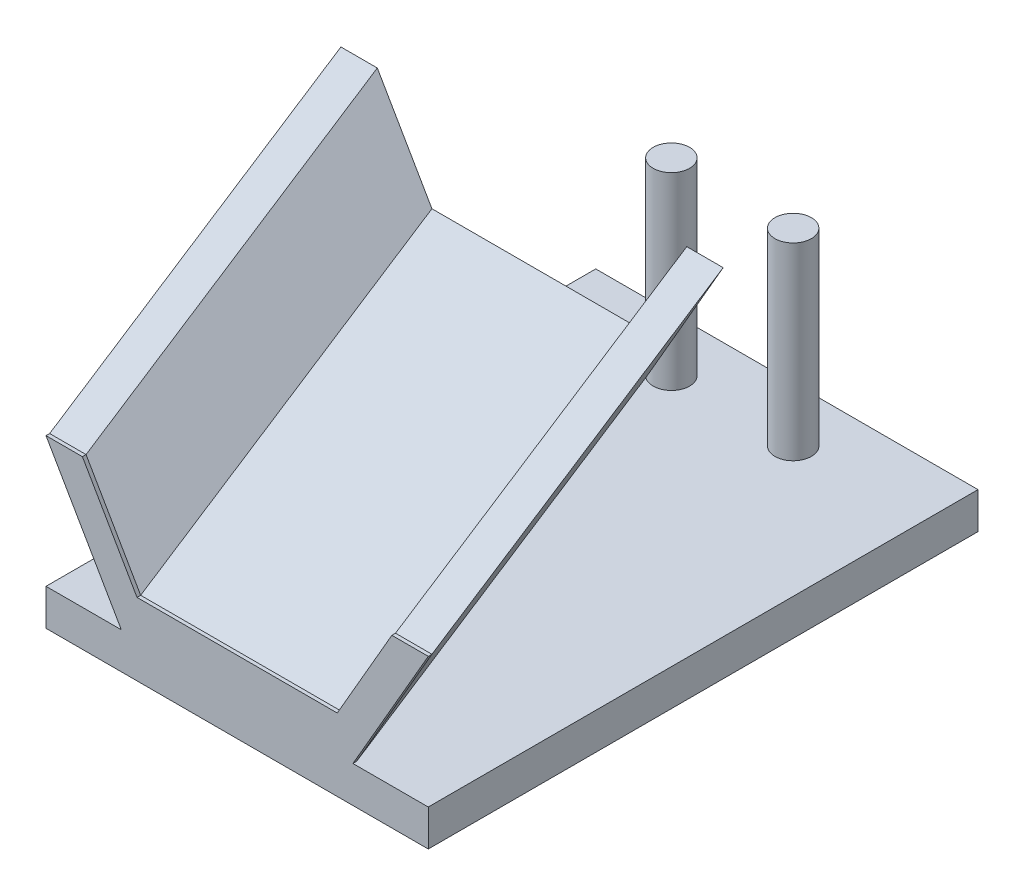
ISO-10303-21;
HEADER;
FILE_DESCRIPTION(('STEP AP214'),'2;1');
FILE_NAME('part.step','',(''),(''),'','','');
FILE_SCHEMA(('AUTOMOTIVE_DESIGN { 1 0 10303 214 1 1 1 1 }'));
ENDSEC;
DATA;
#1=APPLICATION_CONTEXT('core data for automotive mechanical design processes');
#2=APPLICATION_PROTOCOL_DEFINITION('international standard','automotive_design',2000,#1);
#3=PRODUCT_CONTEXT('',#1,'mechanical');
#4=PRODUCT('Part','Part','',(#3));
#5=PRODUCT_RELATED_PRODUCT_CATEGORY('part','',(#4));
#6=PRODUCT_DEFINITION_FORMATION('','',#4);
#7=PRODUCT_DEFINITION_CONTEXT('part definition',#1,'design');
#8=PRODUCT_DEFINITION('design','',#6,#7);
#9=PRODUCT_DEFINITION_SHAPE('','',#8);
#10=(LENGTH_UNIT() NAMED_UNIT(*) SI_UNIT(.MILLI.,.METRE.));
#11=(NAMED_UNIT(*) PLANE_ANGLE_UNIT() SI_UNIT($,.RADIAN.));
#12=(NAMED_UNIT(*) SI_UNIT($,.STERADIAN.) SOLID_ANGLE_UNIT());
#13=UNCERTAINTY_MEASURE_WITH_UNIT(LENGTH_MEASURE(1.E-05),#10,'distance_accuracy_value','');
#14=(GEOMETRIC_REPRESENTATION_CONTEXT(3) GLOBAL_UNCERTAINTY_ASSIGNED_CONTEXT((#13)) GLOBAL_UNIT_ASSIGNED_CONTEXT((#10,
#11,#12)) REPRESENTATION_CONTEXT('',''));
#15=CARTESIAN_POINT('',(0.,0.,0.));
#16=DIRECTION('',(0.,0.,1.));
#17=DIRECTION('',(1.,0.,0.));
#18=AXIS2_PLACEMENT_3D('',#15,#16,#17);
#19=CARTESIAN_POINT('',(-20.5691061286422,31.2155211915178,-80.));
#20=CARTESIAN_POINT('',(-20.6536279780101,-20.6015526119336,0.));
#21=CARTESIAN_POINT('',(42.883888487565,31.2155211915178,-80.));
#22=CARTESIAN_POINT('',(42.8806157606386,-20.742280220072,0.));
#23=B_SPLINE_SURFACE_WITH_KNOTS('',1,1,((#19,#20),(#21,#22)),.UNSPECIFIED.,.F.,.F.,.F.,(2,2),(2,
2),(0.,1.),(0.,1.),.UNSPECIFIED.);
#24=CARTESIAN_POINT('',(-20.6536279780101,-20.6015526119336,0.));
#25=CARTESIAN_POINT('',(-10.0645862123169,-20.6015526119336,-0.0362112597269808));
#26=CARTESIAN_POINT('',(0.524455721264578,-20.6015526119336,-0.072373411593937));
#27=CARTESIAN_POINT('',(16.4080188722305,-20.6015526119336,-0.126543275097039));
#28=CARTESIAN_POINT('',(21.7025399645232,-20.6015526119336,-0.144587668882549));
#29=CARTESIAN_POINT('',(32.2915822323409,-20.6015526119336,-0.180652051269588));
#30=CARTESIAN_POINT('',(37.5861034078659,-20.6015526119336,-0.198672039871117));
#31=CARTESIAN_POINT('',(42.8806246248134,-20.6015526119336,-0.216679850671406));
#32=B_SPLINE_CURVE_WITH_KNOTS('',3,(#24,#25,#26,#27,#28,#29,#30,#31),.UNSPECIFIED.,.F.,.F.,(4,2,
2,4),(0.,31.7673110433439,47.6509665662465,63.5346220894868),.UNSPECIFIED.);
#33=CARTESIAN_POINT('',(-20.6536279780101,-20.6015526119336,0.));
#34=VERTEX_POINT('',#33);
#35=CARTESIAN_POINT('',(42.8806246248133,-20.6015526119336,-0.216679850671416));
#36=VERTEX_POINT('',#35);
#37=EDGE_CURVE('E325',#34,#36,#32,.T.);
#38=DIRECTION('',(-0.000886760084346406,-0.543638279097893,0.839319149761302));
#39=VECTOR('',#38,1.);
#40=CARTESIAN_POINT('',(-20.6113670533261,5.3069842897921,-40.));
#41=LINE('',#40,#39);
#42=CARTESIAN_POINT('',(-20.5691061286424,31.215521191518,-79.9999999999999));
#43=VERTEX_POINT('',#42);
#44=EDGE_CURVE('E268',#43,#34,#41,.T.);
#45=DIRECTION('',(-1.,0.,0.));
#46=VECTOR('',#45,1.);
#47=CARTESIAN_POINT('',(42.883888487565,31.2155211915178,-80.0000000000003));
#48=LINE('',#47,#46);
#49=CARTESIAN_POINT('',(42.883888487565,31.215521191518,-80.0000000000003));
#50=VERTEX_POINT('',#49);
#51=EDGE_CURVE('E255',#50,#43,#48,.T.);
#52=DIRECTION('',(-3.43082293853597E-05,-0.544677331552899,0.838645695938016));
#53=VECTOR('',#52,1.);
#54=CARTESIAN_POINT('',(42.8822521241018,5.23662048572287,-40.));
#55=LINE('',#54,#53);
#56=EDGE_CURVE('E265',#50,#36,#55,.T.);
#57=CARTESIAN_POINT('',(-0.637780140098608,-10.9218588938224,-14.9999916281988));
#58=CARTESIAN_POINT('',(-0.637779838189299,-11.0377173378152,-14.8212718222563));
#59=CARTESIAN_POINT('',(-0.647357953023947,-11.1535371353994,-14.6425850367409));
#60=CARTESIAN_POINT('',(-0.685691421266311,-11.3842012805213,-14.2866616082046));
#61=CARTESIAN_POINT('',(-0.714442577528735,-11.4990458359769,-14.1094246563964));
#62=CARTESIAN_POINT('',(-0.791226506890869,-11.7269376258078,-13.7576671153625));
#63=CARTESIAN_POINT('',(-0.839283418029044,-11.8399824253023,-13.5831502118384));
#64=CARTESIAN_POINT('',(-0.954760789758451,-12.0630962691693,-13.2386491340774));
#65=CARTESIAN_POINT('',(-1.02218095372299,-12.1731653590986,-13.0686648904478));
#66=CARTESIAN_POINT('',(-1.17007832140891,-12.3802767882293,-12.7487507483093));
#67=CARTESIAN_POINT('',(-1.24902150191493,-12.4776451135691,-12.5983226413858));
#68=CARTESIAN_POINT('',(-1.42320889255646,-12.6678957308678,-12.3043363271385));
#69=CARTESIAN_POINT('',(-1.518443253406,-12.7607806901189,-12.160774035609));
#70=CARTESIAN_POINT('',(-1.72495137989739,-12.9408857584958,-11.8823379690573));
#71=CARTESIAN_POINT('',(-1.83619636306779,-13.0281156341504,-11.7474492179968));
#72=CARTESIAN_POINT('',(-2.07455690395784,-13.1958810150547,-11.4879484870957));
#73=CARTESIAN_POINT('',(-2.20166559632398,-13.2764193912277,-11.3633321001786));
#74=CARTESIAN_POINT('',(-2.43134522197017,-13.406877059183,-11.1614027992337));
#75=CARTESIAN_POINT('',(-2.53007056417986,-13.458812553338,-11.080991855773));
#76=CARTESIAN_POINT('',(-2.73481303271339,-13.5582344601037,-10.9270100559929));
#77=CARTESIAN_POINT('',(-2.84082842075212,-13.6057219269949,-10.8534375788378));
#78=CARTESIAN_POINT('',(-3.05974098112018,-13.6957497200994,-10.7139023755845));
#79=CARTESIAN_POINT('',(-3.17263754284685,-13.7382904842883,-10.6479389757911));
#80=CARTESIAN_POINT('',(-3.40471934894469,-13.8179064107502,-10.5244237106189));
#81=CARTESIAN_POINT('',(-3.52390152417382,-13.8549842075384,-10.4668677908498));
#82=CARTESIAN_POINT('',(-3.76873788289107,-13.9234396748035,-10.3605290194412));
#83=CARTESIAN_POINT('',(-3.89443061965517,-13.9547768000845,-10.3118085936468));
#84=CARTESIAN_POINT('',(-4.15059709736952,-14.010959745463,-10.22436679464));
#85=CARTESIAN_POINT('',(-4.28106860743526,-14.0358085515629,-10.1856408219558));
#86=CARTESIAN_POINT('',(-4.5457779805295,-14.0786290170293,-10.1187866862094));
#87=CARTESIAN_POINT('',(-4.68001501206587,-14.0966021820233,-10.0906562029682));
#88=CARTESIAN_POINT('',(-4.95109320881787,-14.125368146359,-10.0454648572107));
#89=CARTESIAN_POINT('',(-5.08793407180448,-14.1361617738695,-10.0284027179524));
#90=CARTESIAN_POINT('',(-5.3479624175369,-14.1496054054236,-10.0068834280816));
#91=CARTESIAN_POINT('',(-5.47101574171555,-14.1530135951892,-10.0012569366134));
#92=CARTESIAN_POINT('',(-5.71722157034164,-14.1539294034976,-9.99910759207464));
#93=CARTESIAN_POINT('',(-5.84037406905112,-14.1514373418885,-10.0025842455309));
#94=CARTESIAN_POINT('',(-6.08579750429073,-14.140590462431,-10.0185862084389));
#95=CARTESIAN_POINT('',(-6.20806864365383,-14.1322370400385,-10.0311093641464));
#96=CARTESIAN_POINT('',(-6.4508385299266,-14.1097898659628,-10.065018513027));
#97=CARTESIAN_POINT('',(-6.57133726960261,-14.0956960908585,-10.0864045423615));
#98=CARTESIAN_POINT('',(-6.80531585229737,-14.0625828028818,-10.1367986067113));
#99=CARTESIAN_POINT('',(-6.91889082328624,-14.04376358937,-10.1654972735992));
#100=CARTESIAN_POINT('',(-7.14291679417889,-14.0012122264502,-10.2304854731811));
#101=CARTESIAN_POINT('',(-7.25336677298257,-13.9774784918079,-10.2667774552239));
#102=CARTESIAN_POINT('',(-7.57901238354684,-13.8993076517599,-10.3864263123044));
#103=CARTESIAN_POINT('',(-7.78868734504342,-13.8378744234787,-10.4805964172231));
#104=CARTESIAN_POINT('',(-8.20273716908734,-13.6941299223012,-10.7011738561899));
#105=CARTESIAN_POINT('',(-8.40575522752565,-13.6106731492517,-10.8293531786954));
#106=CARTESIAN_POINT('',(-8.78715599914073,-13.4285214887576,-11.1093052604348));
#107=CARTESIAN_POINT('',(-8.96552753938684,-13.3298197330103,-11.261088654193));
#108=CARTESIAN_POINT('',(-9.31854927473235,-13.1057946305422,-11.6057538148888));
#109=CARTESIAN_POINT('',(-9.48933658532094,-12.9786767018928,-11.8014171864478));
#110=CARTESIAN_POINT('',(-9.79596024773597,-12.71231220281,-12.2115700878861));
#111=CARTESIAN_POINT('',(-9.9317216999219,-12.5730404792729,-12.4260986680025));
#112=CARTESIAN_POINT('',(-10.1867135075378,-12.2626990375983,-12.9042805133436));
#113=CARTESIAN_POINT('',(-10.2997292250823,-12.0901273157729,-13.1702707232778));
#114=CARTESIAN_POINT('',(-10.4777543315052,-11.7380651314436,-13.713071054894));
#115=CARTESIAN_POINT('',(-10.5428048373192,-11.5585807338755,-13.989871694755));
#116=CARTESIAN_POINT('',(-10.6074434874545,-11.2750474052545,-14.4272459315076));
#117=CARTESIAN_POINT('',(-10.6231809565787,-11.1719895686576,-14.586243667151));
#118=CARTESIAN_POINT('',(-10.6394133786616,-10.9656217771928,-14.9046710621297));
#119=CARTESIAN_POINT('',(-10.6399180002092,-10.8623120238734,-15.0641003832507));
#120=CARTESIAN_POINT('',(-10.6185196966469,-10.5526199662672,-15.5420852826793));
#121=CARTESIAN_POINT('',(-10.5736921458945,-10.3465299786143,-15.8602527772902));
#122=CARTESIAN_POINT('',(-10.4587617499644,-10.0380464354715,-16.3366242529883));
#123=CARTESIAN_POINT('',(-10.4108578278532,-9.93300345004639,-16.4988585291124));
#124=CARTESIAN_POINT('',(-10.2981617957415,-9.72559834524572,-16.8192333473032));
#125=CARTESIAN_POINT('',(-10.2333691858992,-9.62323630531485,-16.9773737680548));
#126=CARTESIAN_POINT('',(-10.0869357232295,-9.42227692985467,-17.2878872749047));
#127=CARTESIAN_POINT('',(-10.0053118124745,-9.32367592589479,-17.4402659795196));
#128=CARTESIAN_POINT('',(-9.82519697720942,-9.13116195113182,-17.7378304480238));
#129=CARTESIAN_POINT('',(-9.72671146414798,-9.03724748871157,-17.8830185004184));
#130=CARTESIAN_POINT('',(-9.53854836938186,-8.87698894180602,-18.1308218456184));
#131=CARTESIAN_POINT('',(-9.45238436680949,-8.80941689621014,-18.2353235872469));
#132=CARTESIAN_POINT('',(-9.27050135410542,-8.67819967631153,-18.4382901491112));
#133=CARTESIAN_POINT('',(-9.17478433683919,-8.61455368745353,-18.5367562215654));
#134=CARTESIAN_POINT('',(-8.97400025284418,-8.49177134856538,-18.726751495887));
#135=CARTESIAN_POINT('',(-8.86893280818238,-8.43263518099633,-18.8182804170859));
#136=CARTESIAN_POINT('',(-8.64983776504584,-8.31953266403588,-18.9933816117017));
#137=CARTESIAN_POINT('',(-8.53581408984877,-8.26556407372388,-19.0769573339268));
#138=CARTESIAN_POINT('',(-8.29825108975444,-8.16299425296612,-19.2358488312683));
#139=CARTESIAN_POINT('',(-8.17463887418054,-8.11444274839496,-19.3110880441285));
#140=CARTESIAN_POINT('',(-7.91953385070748,-8.02395907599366,-19.4513705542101));
#141=CARTESIAN_POINT('',(-7.78804529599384,-7.98202337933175,-19.5164192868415));
#142=CARTESIAN_POINT('',(-7.51812616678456,-7.9054350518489,-19.6352945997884));
#143=CARTESIAN_POINT('',(-7.37969908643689,-7.87077879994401,-19.6891267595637));
#144=CARTESIAN_POINT('',(-7.09702739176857,-7.80935114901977,-19.7846379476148));
#145=CARTESIAN_POINT('',(-6.95278389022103,-7.78257824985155,-19.8263192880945));
#146=CARTESIAN_POINT('',(-6.68029604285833,-7.7405818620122,-19.8918190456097));
#147=CARTESIAN_POINT('',(-6.55262027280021,-7.72426934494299,-19.9173165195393));
#148=CARTESIAN_POINT('',(-6.29502546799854,-7.6981225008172,-19.9583210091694));
#149=CARTESIAN_POINT('',(-6.16510671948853,-7.68828735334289,-19.9738292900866));
#150=CARTESIAN_POINT('',(-5.90418933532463,-7.67525697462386,-19.9946033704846));
#151=CARTESIAN_POINT('',(-5.77319128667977,-7.67205834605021,-19.9998744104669));
#152=CARTESIAN_POINT('',(-5.51119527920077,-7.67234430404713,-20.0001049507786));
#153=CARTESIAN_POINT('',(-5.38019732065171,-7.67582857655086,-19.9950649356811));
#154=CARTESIAN_POINT('',(-5.13137122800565,-7.68879424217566,-19.9756986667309));
#155=CARTESIAN_POINT('',(-5.01344129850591,-7.69769376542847,-19.9622703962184));
#156=CARTESIAN_POINT('',(-4.77930087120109,-7.72083722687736,-19.9271643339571));
#157=CARTESIAN_POINT('',(-4.66309104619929,-7.73508320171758,-19.9054833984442));
#158=CARTESIAN_POINT('',(-4.43324432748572,-7.76873128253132,-19.8541606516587));
#159=CARTESIAN_POINT('',(-4.31960672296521,-7.78813194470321,-19.8245210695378));
#160=CARTESIAN_POINT('',(-4.09555916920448,-7.83185541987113,-19.7576406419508));
#161=CARTESIAN_POINT('',(-3.98514944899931,-7.85617858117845,-19.720399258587));
#162=CARTESIAN_POINT('',(-3.76580680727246,-7.91005065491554,-19.6378516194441));
#163=CARTESIAN_POINT('',(-3.65695874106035,-7.93970205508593,-19.5923870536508));
#164=CARTESIAN_POINT('',(-3.44384869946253,-8.00352170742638,-19.4944789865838));
#165=CARTESIAN_POINT('',(-3.33958620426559,-8.03768944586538,-19.4420362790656));
#166=CARTESIAN_POINT('',(-3.13608293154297,-8.11020442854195,-19.3306914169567));
#167=CARTESIAN_POINT('',(-3.03684229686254,-8.1485517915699,-19.2717890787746));
#168=CARTESIAN_POINT('',(-2.84371955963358,-8.22908442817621,-19.1480511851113));
#169=CARTESIAN_POINT('',(-2.74984030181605,-8.27127170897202,-19.0832125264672));
#170=CARTESIAN_POINT('',(-2.45670578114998,-8.41273606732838,-18.8657387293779));
#171=CARTESIAN_POINT('',(-2.2685030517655,-8.51891511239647,-18.702430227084));
#172=CARTESIAN_POINT('',(-1.92211191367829,-8.74490294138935,-18.3547160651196));
#173=CARTESIAN_POINT('',(-1.76395253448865,-8.8647247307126,-18.1702902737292));
#174=CARTESIAN_POINT('',(-1.53873078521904,-9.06202258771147,-17.8665283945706));
#175=CARTESIAN_POINT('',(-1.46134744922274,-9.13609089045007,-17.752474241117));
#176=CARTESIAN_POINT('',(-1.31705042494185,-9.28709819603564,-17.5199117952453));
#177=CARTESIAN_POINT('',(-1.25012695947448,-9.36403443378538,-17.4014077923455));
#178=CARTESIAN_POINT('',(-1.12666782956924,-9.52036008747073,-17.1605895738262));
#179=CARTESIAN_POINT('',(-1.07013674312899,-9.59975056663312,-17.0382737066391));
#180=CARTESIAN_POINT('',(-0.967476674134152,-9.76049183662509,-16.7905916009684));
#181=CARTESIAN_POINT('',(-0.921350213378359,-9.84184309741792,-16.6652246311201));
#182=CARTESIAN_POINT('',(-0.799498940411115,-10.0863001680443,-16.2884588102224));
#183=CARTESIAN_POINT('',(-0.738843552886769,-10.2516816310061,-16.0335106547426));
#184=CARTESIAN_POINT('',(-0.657971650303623,-10.5853543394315,-15.5190175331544));
#185=CARTESIAN_POINT('',(-0.637780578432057,-10.7536473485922,-15.2594697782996));
#186=CARTESIAN_POINT('',(-0.637780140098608,-10.9218588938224,-14.9999916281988));
#187=B_SPLINE_CURVE_WITH_KNOTS('',3,(#57,#58,#59,#60,#61,#62,#63,#64,#65,#66,#67,#68,#69,#70,
#71,#72,#73,#74,#75,#76,#77,#78,#79,#80,#81,#82,#83,#84,#85,#86,#87,#88,#89,#90,#91,#92,#93,#94,
#95,#96,#97,#98,#99,#100,#101,#102,#103,#104,#105,#106,#107,#108,#109,#110,#111,#112,#113,#114,
#115,#116,#117,#118,#119,#120,#121,#122,#123,#124,#125,#126,#127,#128,#129,#130,#131,#132,#133,
#134,#135,#136,#137,#138,#139,#140,#141,#142,#143,#144,#145,#146,#147,#148,#149,#150,#151,#152,
#153,#154,#155,#156,#157,#158,#159,#160,#161,#162,#163,#164,#165,#166,#167,#168,#169,#170,#171,
#172,#173,#174,#175,#176,#177,#178,#179,#180,#181,#182,#183,#184,#185,#186),.UNSPECIFIED.,.T.,
.F.,(4,2,2,2,2,2,2,2,2,2,2,2,2,2,2,2,2,2,2,2,2,2,2,2,2,2,2,2,2,2,2,2,2,2,2,2,2,2,2,2,2,2,2,2,2,
2,2,2,2,2,2,2,2,2,2,2,2,2,2,2,2,2,2,2,4),(0.,0.638663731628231,1.27718770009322,
1.91651251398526,2.55582753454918,3.1424535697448,3.72872618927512,4.31395772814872,
4.89893686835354,5.31108548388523,5.72313616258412,6.13515033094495,6.54696515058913,
6.96158494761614,7.37601359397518,7.79035143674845,8.2046414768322,8.5738618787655,
8.9430622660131,9.31217478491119,9.68128880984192,10.0368227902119,10.3924716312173,
11.1032061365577,11.8628323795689,12.6228018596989,13.4869623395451,14.3529557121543,
15.3588629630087,16.3639069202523,16.9337253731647,17.5031821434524,18.642398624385,
19.2391630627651,19.8359451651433,20.4321294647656,21.0281227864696,21.4817814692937,
21.9353457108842,22.3889282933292,22.8423132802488,23.2995667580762,23.7565755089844,
24.2133563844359,24.6700502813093,25.0631590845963,25.4562180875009,25.849075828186,
26.2419151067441,26.5985750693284,26.9553710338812,27.3120671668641,27.6687885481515,
28.0332972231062,28.3977644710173,28.7622420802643,29.1269113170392,29.9361270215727,
30.7461207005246,31.2151349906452,31.6837082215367,32.1524873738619,32.621380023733,
33.5480550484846,34.4753125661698),.UNSPECIFIED.);
#188=CARTESIAN_POINT('',(-0.637780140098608,-10.9218588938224,-14.9999916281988));
#189=VERTEX_POINT('',#188);
#190=EDGE_CURVE('E12',#189,#189,#187,.T.);
#191=CARTESIAN_POINT('',(32.8647679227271,-10.9821671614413,-14.9999916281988));
#192=CARTESIAN_POINT('',(32.8647682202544,-11.0981379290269,-14.8213539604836));
#193=CARTESIAN_POINT('',(32.85519894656,-11.2140698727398,-14.6427495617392));
#194=CARTESIAN_POINT('',(32.816900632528,-11.444959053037,-14.2869877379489));
#195=CARTESIAN_POINT('',(32.7881758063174,-11.5599164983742,-14.1098300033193));
#196=CARTESIAN_POINT('',(32.7114614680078,-11.7880354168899,-13.758224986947));
#197=CARTESIAN_POINT('',(32.6634478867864,-11.9011944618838,-13.583781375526));
#198=CARTESIAN_POINT('',(32.5480728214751,-12.124539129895,-13.239416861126));
#199=CARTESIAN_POINT('',(32.480711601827,-12.2347247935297,-13.0694958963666));
#200=CARTESIAN_POINT('',(32.3328790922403,-12.4421483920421,-12.7495578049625));
#201=CARTESIAN_POINT('',(32.2539265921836,-12.5397090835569,-12.5990481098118));
#202=CARTESIAN_POINT('',(32.079701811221,-12.7303382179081,-12.3048983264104));
#203=CARTESIAN_POINT('',(31.9844393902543,-12.823409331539,-12.1612541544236));
#204=CARTESIAN_POINT('',(31.777854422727,-13.0038771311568,-11.8826566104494));
#205=CARTESIAN_POINT('',(31.6665607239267,-13.0912836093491,-11.7476882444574));
#206=CARTESIAN_POINT('',(31.428079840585,-13.2593891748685,-11.4880335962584));
#207=CARTESIAN_POINT('',(31.3008995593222,-13.3400911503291,-11.3633428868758));
#208=CARTESIAN_POINT('',(31.0711605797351,-13.4707650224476,-11.1613686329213));
#209=CARTESIAN_POINT('',(30.9724602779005,-13.5227611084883,-11.0809792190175));
#210=CARTESIAN_POINT('',(30.7677680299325,-13.622301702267,-10.9270345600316));
#211=CARTESIAN_POINT('',(30.6617778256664,-13.6698472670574,-10.8534776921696));
#212=CARTESIAN_POINT('',(30.442914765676,-13.7599879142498,-10.7139679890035));
#213=CARTESIAN_POINT('',(30.3300425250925,-13.8025834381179,-10.6480144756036));
#214=CARTESIAN_POINT('',(30.0980074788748,-13.8823045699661,-10.5245136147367));
#215=CARTESIAN_POINT('',(29.9788477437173,-13.9194328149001,-10.4669622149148));
#216=CARTESIAN_POINT('',(29.7340516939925,-13.9879846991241,-10.3606268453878));
#217=CARTESIAN_POINT('',(29.6083767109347,-14.0193676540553,-10.3119054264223));
#218=CARTESIAN_POINT('',(29.3522425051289,-14.0756353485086,-10.224458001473));
#219=CARTESIAN_POINT('',(29.2217855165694,-14.1005230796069,-10.1857273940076));
#220=CARTESIAN_POINT('',(28.9571021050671,-14.1434133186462,-10.1188612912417));
#221=CARTESIAN_POINT('',(28.8228765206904,-14.1614173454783,-10.090723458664));
#222=CARTESIAN_POINT('',(28.551818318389,-14.1902360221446,-10.0455154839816));
#223=CARTESIAN_POINT('',(28.4149860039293,-14.2010515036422,-10.0284440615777));
#224=CARTESIAN_POINT('',(28.1550014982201,-14.2145257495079,-10.0069084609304));
#225=CARTESIAN_POINT('',(28.031983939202,-14.2179451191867,-10.0012728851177));
#226=CARTESIAN_POINT('',(27.7858483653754,-14.218878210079,-9.99910019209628));
#227=CARTESIAN_POINT('',(27.6627303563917,-14.2163922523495,-10.0025625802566));
#228=CARTESIAN_POINT('',(27.4173746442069,-14.2055524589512,-10.0185309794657));
#229=CARTESIAN_POINT('',(27.2951367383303,-14.1972000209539,-10.0310348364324));
#230=CARTESIAN_POINT('',(27.0524320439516,-14.1747498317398,-10.064900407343));
#231=CARTESIAN_POINT('',(26.9319652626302,-14.1606520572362,-10.0862621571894));
#232=CARTESIAN_POINT('',(26.6980634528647,-14.1275284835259,-10.1366003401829));
#233=CARTESIAN_POINT('',(26.5845330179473,-14.1087038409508,-10.1652665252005));
#234=CARTESIAN_POINT('',(26.3605937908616,-14.0661389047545,-10.230183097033));
#235=CARTESIAN_POINT('',(26.2501860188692,-14.0423970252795,-10.2664359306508));
#236=CARTESIAN_POINT('',(25.9246627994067,-13.9641981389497,-10.385957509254));
#237=CARTESIAN_POINT('',(25.7150639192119,-13.9027413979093,-10.4800295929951));
#238=CARTESIAN_POINT('',(25.3011318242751,-13.7589327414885,-10.7003912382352));
#239=CARTESIAN_POINT('',(25.0981566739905,-13.6754328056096,-10.8284541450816));
#240=CARTESIAN_POINT('',(24.7168236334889,-13.493186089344,-11.1081530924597));
#241=CARTESIAN_POINT('',(24.538476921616,-13.3944324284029,-11.2597997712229));
#242=CARTESIAN_POINT('',(24.1854377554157,-13.1702605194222,-11.604198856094));
#243=CARTESIAN_POINT('',(24.0146130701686,-13.0430428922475,-11.7997363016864));
#244=CARTESIAN_POINT('',(23.7078951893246,-12.7764672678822,-12.2096284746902));
#245=CARTESIAN_POINT('',(23.5720768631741,-12.6370840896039,-12.4240222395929));
#246=CARTESIAN_POINT('',(23.3168910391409,-12.3264379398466,-12.9019901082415));
#247=CARTESIAN_POINT('',(23.2037492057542,-12.1536675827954,-13.1679061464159));
#248=CARTESIAN_POINT('',(23.0254620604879,-11.8011931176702,-13.7105657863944));
#249=CARTESIAN_POINT('',(22.9602757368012,-11.6214950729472,-13.9872999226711));
#250=CARTESIAN_POINT('',(22.8954052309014,-11.3375819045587,-14.4246341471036));
#251=CARTESIAN_POINT('',(22.8795817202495,-11.2343618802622,-14.5836544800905));
#252=CARTESIAN_POINT('',(22.8631827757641,-11.0276659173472,-14.9021323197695));
#253=CARTESIAN_POINT('',(22.8625976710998,-10.9241901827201,-15.0615894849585));
#254=CARTESIAN_POINT('',(22.88376219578,-10.6139944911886,-15.5396671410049));
#255=CARTESIAN_POINT('',(22.9284443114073,-10.4075618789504,-15.8579077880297));
#256=CARTESIAN_POINT('',(23.0431821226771,-10.0985244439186,-16.3344518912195));
#257=CARTESIAN_POINT('',(23.0910340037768,-9.9932731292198,-16.4967753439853));
#258=CARTESIAN_POINT('',(23.2036425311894,-9.78545181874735,-16.8173337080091));
#259=CARTESIAN_POINT('',(23.2683996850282,-9.68288190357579,-16.9755684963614));
#260=CARTESIAN_POINT('',(23.4147804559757,-9.48150971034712,-17.2862745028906));
#261=CARTESIAN_POINT('',(23.4963870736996,-9.38270375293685,-17.4387513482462));
#262=CARTESIAN_POINT('',(23.6764877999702,-9.18978481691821,-17.736514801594));
#263=CARTESIAN_POINT('',(23.7749764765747,-9.09567034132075,-17.8818037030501));
#264=CARTESIAN_POINT('',(23.9631216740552,-8.93510397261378,-18.1297274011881));
#265=CARTESIAN_POINT('',(24.0492545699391,-8.86742059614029,-18.2342513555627));
#266=CARTESIAN_POINT('',(24.231079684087,-8.73598256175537,-18.4372681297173));
#267=CARTESIAN_POINT('',(24.3267699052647,-8.67222708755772,-18.5357622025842));
#268=CARTESIAN_POINT('',(24.5275063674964,-8.54922858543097,-18.7258190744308));
#269=CARTESIAN_POINT('',(24.6325529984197,-8.48998574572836,-18.8173815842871));
#270=CARTESIAN_POINT('',(24.851613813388,-8.3766742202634,-18.9925546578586));
#271=CARTESIAN_POINT('',(24.9656240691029,-8.32260329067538,-19.0761686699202));
#272=CARTESIAN_POINT('',(25.2031717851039,-8.21983271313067,-19.2351425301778));
#273=CARTESIAN_POINT('',(25.3267824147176,-8.17118298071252,-19.3104256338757));
#274=CARTESIAN_POINT('',(25.581894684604,-8.08051141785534,-19.4507973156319));
#275=CARTESIAN_POINT('',(25.7133920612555,-8.03848605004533,-19.5158913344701));
#276=CARTESIAN_POINT('',(25.9833393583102,-7.96172940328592,-19.634856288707));
#277=CARTESIAN_POINT('',(26.1217857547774,-7.92699447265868,-19.6887328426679));
#278=CARTESIAN_POINT('',(26.4045067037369,-7.86542274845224,-19.7843297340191));
#279=CARTESIAN_POINT('',(26.5487801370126,-7.83858444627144,-19.8260523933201));
#280=CARTESIAN_POINT('',(26.8212869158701,-7.79648787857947,-19.8916130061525));
#281=CARTESIAN_POINT('',(26.9489493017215,-7.78013631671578,-19.9171341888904));
#282=CARTESIAN_POINT('',(27.2065216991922,-7.75391938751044,-19.9581880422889));
#283=CARTESIAN_POINT('',(27.3364314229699,-7.74405319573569,-19.9737219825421));
#284=CARTESIAN_POINT('',(27.5973344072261,-7.73096950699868,-19.9945484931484));
#285=CARTESIAN_POINT('',(27.7283270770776,-7.72774859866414,-19.9998463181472));
#286=CARTESIAN_POINT('',(27.9903153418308,-7.72799918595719,-20.0001310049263));
#287=CARTESIAN_POINT('',(28.1213109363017,-7.73147036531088,-19.9951183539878));
#288=CARTESIAN_POINT('',(28.3700933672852,-7.74441777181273,-19.9758077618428));
#289=CARTESIAN_POINT('',(28.4879821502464,-7.7533094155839,-19.9624107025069));
#290=CARTESIAN_POINT('',(28.7220428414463,-7.77644094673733,-19.927372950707));
#291=CARTESIAN_POINT('',(28.8382140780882,-7.79068287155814,-19.9057291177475));
#292=CARTESIAN_POINT('',(29.0679863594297,-7.82432653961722,-19.8544862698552));
#293=CARTESIAN_POINT('',(29.1815881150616,-7.84372683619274,-19.824889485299));
#294=CARTESIAN_POINT('',(29.4055669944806,-7.88745303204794,-19.7581001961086));
#295=CARTESIAN_POINT('',(29.5159438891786,-7.91177928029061,-19.7209071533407));
#296=CARTESIAN_POINT('',(29.7352203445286,-7.96566000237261,-19.6384638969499));
#297=CARTESIAN_POINT('',(29.8440352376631,-7.99531689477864,-19.5930557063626));
#298=CARTESIAN_POINT('',(30.0570830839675,-8.05915022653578,-19.49526621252));
#299=CARTESIAN_POINT('',(30.1613165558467,-8.09332615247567,-19.4428857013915));
#300=CARTESIAN_POINT('',(30.3647664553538,-8.16585990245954,-19.331670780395));
#301=CARTESIAN_POINT('',(30.4639827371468,-8.20421784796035,-19.272836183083));
#302=CARTESIAN_POINT('',(30.6570618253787,-8.2847737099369,-19.1492390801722));
#303=CARTESIAN_POINT('',(30.7509217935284,-8.32697363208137,-19.0844734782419));
#304=CARTESIAN_POINT('',(31.0440376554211,-8.46849818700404,-18.8672174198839));
#305=CARTESIAN_POINT('',(31.2322473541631,-8.57473128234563,-18.7040588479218));
#306=CARTESIAN_POINT('',(31.578675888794,-8.80083834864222,-18.3566575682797));
#307=CARTESIAN_POINT('',(31.7368656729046,-8.9207253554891,-18.1723947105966));
#308=CARTESIAN_POINT('',(31.9621807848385,-9.11815358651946,-17.8688659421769));
#309=CARTESIAN_POINT('',(32.0396148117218,-9.19228501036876,-17.7548775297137));
#310=CARTESIAN_POINT('',(32.1840175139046,-9.3434227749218,-17.5224464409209));
#311=CARTESIAN_POINT('',(32.2509959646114,-9.4204263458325,-17.4040080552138));
#312=CARTESIAN_POINT('',(32.37457057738,-9.57689094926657,-17.1633199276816));
#313=CARTESIAN_POINT('',(32.4311621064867,-9.65635306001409,-17.0410685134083));
#314=CARTESIAN_POINT('',(32.5339488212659,-9.81724116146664,-16.7935141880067));
#315=CARTESIAN_POINT('',(32.5801414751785,-9.89866762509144,-16.6682105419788));
#316=CARTESIAN_POINT('',(32.7023930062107,-10.1437420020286,-16.2910328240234));
#317=CARTESIAN_POINT('',(32.7632949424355,-10.3096853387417,-16.0355838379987));
#318=CARTESIAN_POINT('',(32.8444949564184,-10.6445010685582,-15.5200654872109));
#319=CARTESIAN_POINT('',(32.8647674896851,-10.8133752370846,-15.2599933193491));
#320=CARTESIAN_POINT('',(32.8647679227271,-10.9821671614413,-14.9999916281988));
#321=B_SPLINE_CURVE_WITH_KNOTS('',3,(#191,#192,#193,#194,#195,#196,#197,#198,#199,#200,#201,
#202,#203,#204,#205,#206,#207,#208,#209,#210,#211,#212,#213,#214,#215,#216,#217,#218,#219,#220,
#221,#222,#223,#224,#225,#226,#227,#228,#229,#230,#231,#232,#233,#234,#235,#236,#237,#238,#239,
#240,#241,#242,#243,#244,#245,#246,#247,#248,#249,#250,#251,#252,#253,#254,#255,#256,#257,#258,
#259,#260,#261,#262,#263,#264,#265,#266,#267,#268,#269,#270,#271,#272,#273,#274,#275,#276,#277,
#278,#279,#280,#281,#282,#283,#284,#285,#286,#287,#288,#289,#290,#291,#292,#293,#294,#295,#296,
#297,#298,#299,#300,#301,#302,#303,#304,#305,#306,#307,#308,#309,#310,#311,#312,#313,#314,#315,
#316,#317,#318,#319,#320),.UNSPECIFIED.,.T.,.F.,(4,2,2,2,2,2,2,2,2,2,2,2,2,2,2,2,2,2,2,2,2,2,2,
2,2,2,2,2,2,2,2,2,2,2,2,2,2,2,2,2,2,2,2,2,2,2,2,2,2,2,2,2,2,2,2,2,2,2,2,2,2,2,2,2,4),(0.,
0.638640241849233,1.27714003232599,1.91643905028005,2.55572933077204,3.14284080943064,
3.7295986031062,4.3153134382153,4.90077463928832,5.31290053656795,5.72492829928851,
6.13691928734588,6.54871091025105,6.96331440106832,7.37772659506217,7.7920472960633,
8.20632005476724,8.57543551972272,8.94453091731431,9.31353840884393,9.68254739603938,
10.0379327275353,10.3934328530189,11.1038703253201,11.8632621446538,12.6229975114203,
13.4871018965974,14.3530393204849,15.35920437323,16.3645079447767,16.9346682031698,
17.504466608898,18.6443700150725,19.2416442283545,19.838936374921,20.4356288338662,
21.0321296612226,21.4859305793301,21.9396368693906,22.3933620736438,22.8468895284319,
23.3042974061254,23.7614601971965,24.2183934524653,24.6752393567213,25.0683372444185,
25.4613851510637,25.8542312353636,26.2470587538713,26.6035842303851,26.9602456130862,
27.3168070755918,27.6733938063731,28.0377544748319,28.402073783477,28.7664036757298,
29.1309248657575,29.9399496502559,30.7497534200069,31.2187890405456,31.6873834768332,
32.1561864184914,32.6251033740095,33.5540409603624,34.4835624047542),.UNSPECIFIED.);
#322=CARTESIAN_POINT('',(32.8647679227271,-10.9821671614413,-14.9999916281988));
#323=VERTEX_POINT('',#322);
#324=EDGE_CURVE('E514',#323,#323,#321,.T.);
#325=ORIENTED_EDGE('',*,*,#37,.F.);
#326=ORIENTED_EDGE('',*,*,#44,.F.);
#327=ORIENTED_EDGE('',*,*,#51,.F.);
#328=ORIENTED_EDGE('',*,*,#56,.T.);
#329=EDGE_LOOP('',(#325,#326,#327,#328));
#330=FACE_BOUND('',#329,.T.);
#331=ORIENTED_EDGE('',*,*,#190,.F.);
#332=EDGE_LOOP('',(#331));
#333=FACE_BOUND('',#332,.T.);
#334=ORIENTED_EDGE('',*,*,#324,.F.);
#335=EDGE_LOOP('',(#334));
#336=FACE_BOUND('',#335,.T.);
#337=ADVANCED_FACE('F134',(#330,#333,#336),#23,.T.);
#338=CARTESIAN_POINT('',(38.6573911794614,41.215521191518,-80.));
#339=DIRECTION('',(0.,0.83864569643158,0.544677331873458));
#340=DIRECTION('',(-1.,0.,0.));
#341=AXIS2_PLACEMENT_3D('',#338,#339,#340);
#342=PLANE('',#341);
#343=DIRECTION('',(-1.,0.,0.));
#344=VECTOR('',#343,1.);
#345=CARTESIAN_POINT('',(38.6573911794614,41.215521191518,-80.0000000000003));
#346=LINE('',#345,#344);
#347=CARTESIAN_POINT('',(38.6573911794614,41.215521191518,-80.0000000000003));
#348=VERTEX_POINT('',#347);
#349=CARTESIAN_POINT('',(-16.3426088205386,41.215521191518,-79.9999999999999));
#350=VERTEX_POINT('',#349);
#351=EDGE_CURVE('E406',#348,#350,#346,.T.);
#352=ORIENTED_EDGE('',*,*,#351,.T.);
#353=DIRECTION('',(-3.43082293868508E-05,-0.544677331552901,0.838645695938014));
#354=VECTOR('',#353,1.);
#355=CARTESIAN_POINT('',(-16.3442451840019,15.236620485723,-40.));
#356=LINE('',#355,#354);
#357=CARTESIAN_POINT('',(-16.3458815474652,-10.742280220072,0.));
#358=VERTEX_POINT('',#357);
#359=EDGE_CURVE('E372',#350,#358,#356,.T.);
#360=ORIENTED_EDGE('',*,*,#359,.T.);
#361=DIRECTION('',(-1.,0.,0.));
#362=VECTOR('',#361,1.);
#363=CARTESIAN_POINT('',(11.1541184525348,-10.742280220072,0.));
#364=LINE('',#363,#362);
#365=CARTESIAN_POINT('',(38.6541184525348,-10.742280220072,0.));
#366=VERTEX_POINT('',#365);
#367=EDGE_CURVE('E385',#366,#358,#364,.T.);
#368=ORIENTED_EDGE('',*,*,#367,.F.);
#369=DIRECTION('',(-3.43082293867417E-05,-0.544677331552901,0.838645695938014));
#370=VECTOR('',#369,1.);
#371=CARTESIAN_POINT('',(38.6557548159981,15.236620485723,-40.));
#372=LINE('',#371,#370);
#373=EDGE_CURVE('E382',#348,#366,#372,.T.);
#374=ORIENTED_EDGE('',*,*,#373,.F.);
#375=EDGE_LOOP('',(#352,#360,#368,#374));
#376=FACE_BOUND('',#375,.T.);
#377=ADVANCED_FACE('F462',(#376),#342,.T.);
#378=CARTESIAN_POINT('',(-16.3426088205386,41.215521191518,-80.));
#379=DIRECTION('',(0.823674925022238,0.475548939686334,0.308889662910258));
#380=DIRECTION('',(-0.5,0.866025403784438,0.));
#381=AXIS2_PLACEMENT_3D('',#378,#379,#380);
#382=PLANE('',#381);
#383=DIRECTION('',(-0.5,0.866025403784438,0.));
#384=VECTOR('',#383,1.);
#385=CARTESIAN_POINT('',(-16.3426088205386,41.215521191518,-79.9999999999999));
#386=LINE('',#385,#384);
#387=CARTESIAN_POINT('',(-31.3426088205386,67.1962833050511,-79.9999999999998));
#388=VERTEX_POINT('',#387);
#389=EDGE_CURVE('E409',#350,#388,#386,.T.);
#390=ORIENTED_EDGE('',*,*,#389,.T.);
#391=DIRECTION('',(-3.43082293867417E-05,-0.544677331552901,0.838645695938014));
#392=VECTOR('',#391,1.);
#393=CARTESIAN_POINT('',(-31.3442451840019,41.2173825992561,-40.));
#394=LINE('',#393,#392);
#395=CARTESIAN_POINT('',(-31.3458815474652,15.2384818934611,0.));
#396=VERTEX_POINT('',#395);
#397=EDGE_CURVE('E376',#388,#396,#394,.T.);
#398=ORIENTED_EDGE('',*,*,#397,.T.);
#399=DIRECTION('',(-0.5,0.866025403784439,0.));
#400=VECTOR('',#399,1.);
#401=CARTESIAN_POINT('',(-23.8458815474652,2.24810083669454,0.));
#402=LINE('',#401,#400);
#403=EDGE_CURVE('E388',#358,#396,#402,.T.);
#404=ORIENTED_EDGE('',*,*,#403,.F.);
#405=ORIENTED_EDGE('',*,*,#359,.F.);
#406=EDGE_LOOP('',(#390,#398,#404,#405));
#407=FACE_BOUND('',#406,.T.);
#408=ADVANCED_FACE('F460',(#407),#382,.T.);
#409=CARTESIAN_POINT('',(-31.3426088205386,67.1962833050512,-80.));
#410=DIRECTION('',(0.,0.83864569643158,0.544677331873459));
#411=DIRECTION('',(-1.,0.,0.));
#412=AXIS2_PLACEMENT_3D('',#409,#410,#411);
#413=PLANE('',#412);
#414=DIRECTION('',(-1.,0.,0.));
#415=VECTOR('',#414,1.);
#416=CARTESIAN_POINT('',(-31.3426088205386,67.1962833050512,-79.9999999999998));
#417=LINE('',#416,#415);
#418=CARTESIAN_POINT('',(-41.3426088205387,67.1962833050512,-79.9999999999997));
#419=VERTEX_POINT('',#418);
#420=EDGE_CURVE('E412',#388,#419,#417,.T.);
#421=ORIENTED_EDGE('',*,*,#420,.T.);
#422=DIRECTION('',(-3.43082293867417E-05,-0.544677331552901,0.838645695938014));
#423=VECTOR('',#422,1.);
#424=CARTESIAN_POINT('',(-41.3442451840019,41.2173825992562,-40.));
#425=LINE('',#424,#423);
#426=CARTESIAN_POINT('',(-41.3458815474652,15.2384818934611,0.));
#427=VERTEX_POINT('',#426);
#428=EDGE_CURVE('E273',#419,#427,#425,.T.);
#429=ORIENTED_EDGE('',*,*,#428,.T.);
#430=DIRECTION('',(-1.,0.,0.));
#431=VECTOR('',#430,1.);
#432=CARTESIAN_POINT('',(-36.3458815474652,15.2384818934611,0.));
#433=LINE('',#432,#431);
#434=EDGE_CURVE('E391',#396,#427,#433,.T.);
#435=ORIENTED_EDGE('',*,*,#434,.F.);
#436=ORIENTED_EDGE('',*,*,#397,.F.);
#437=EDGE_LOOP('',(#421,#429,#435,#436));
#438=FACE_BOUND('',#437,.T.);
#439=ADVANCED_FACE('F457',(#438),#413,.T.);
#440=CARTESIAN_POINT('',(-41.3426088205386,67.1962833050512,-80.));
#441=DIRECTION('',(-0.823674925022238,-0.475548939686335,-0.308889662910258));
#442=DIRECTION('',(0.5,-0.866025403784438,0.));
#443=AXIS2_PLACEMENT_3D('',#440,#441,#442);
#444=PLANE('',#443);
#445=DIRECTION('',(0.5,-0.866025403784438,0.));
#446=VECTOR('',#445,1.);
#447=CARTESIAN_POINT('',(-41.3426088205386,67.1962833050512,-79.9999999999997));
#448=LINE('',#447,#446);
#449=EDGE_CURVE('E269',#419,#43,#448,.T.);
#450=ORIENTED_EDGE('',*,*,#449,.T.);
#451=ORIENTED_EDGE('',*,*,#44,.T.);
#452=DIRECTION('',(0.5,-0.866025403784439,0.));
#453=VECTOR('',#452,1.);
#454=CARTESIAN_POINT('',(-30.9997547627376,-2.68153535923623,0.));
#455=LINE('',#454,#453);
#456=EDGE_CURVE('E394',#427,#34,#455,.T.);
#457=ORIENTED_EDGE('',*,*,#456,.F.);
#458=ORIENTED_EDGE('',*,*,#428,.F.);
#459=EDGE_LOOP('',(#450,#451,#457,#458));
#460=FACE_BOUND('',#459,.T.);
#461=ADVANCED_FACE('F446',(#460),#444,.T.);
#462=CARTESIAN_POINT('',(42.883888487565,31.2155211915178,-80.));
#463=DIRECTION('',(0.823692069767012,-0.475558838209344,-0.308828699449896));
#464=DIRECTION('',(0.5,0.866025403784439,0.));
#465=AXIS2_PLACEMENT_3D('',#462,#463,#464);
#466=PLANE('',#465);
#467=DIRECTION('',(0.351067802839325,0.,0.936350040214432));
#468=VECTOR('',#467,1.);
#469=CARTESIAN_POINT('',(16.6544662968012,-20.6015526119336,-70.1657444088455));
#470=LINE('',#469,#468);
#471=CARTESIAN_POINT('',(42.9618648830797,-20.6015526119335,0.));
#472=VERTEX_POINT('',#471);
#473=EDGE_CURVE('E151',#36,#472,#470,.T.);
#474=ORIENTED_EDGE('',*,*,#473,.F.);
#475=ORIENTED_EDGE('',*,*,#56,.F.);
#476=DIRECTION('',(-0.5,-0.866025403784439,0.));
#477=VECTOR('',#476,1.);
#478=CARTESIAN_POINT('',(63.6573911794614,67.1962833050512,-80.0000000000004));
#479=LINE('',#478,#477);
#480=CARTESIAN_POINT('',(63.6573911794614,67.1962833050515,-80.0000000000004));
#481=VERTEX_POINT('',#480);
#482=EDGE_CURVE('E252',#481,#50,#479,.T.);
#483=ORIENTED_EDGE('',*,*,#482,.F.);
#484=DIRECTION('',(-3.43082293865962E-05,-0.544677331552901,0.838645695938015));
#485=VECTOR('',#484,1.);
#486=CARTESIAN_POINT('',(63.6557548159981,41.2173825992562,-40.));
#487=LINE('',#486,#485);
#488=CARTESIAN_POINT('',(63.6541184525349,15.2384818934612,0.));
#489=VERTEX_POINT('',#488);
#490=EDGE_CURVE('E272',#481,#489,#487,.T.);
#491=ORIENTED_EDGE('',*,*,#490,.T.);
#492=DIRECTION('',(0.5,0.866025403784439,0.));
#493=VECTOR('',#492,1.);
#494=CARTESIAN_POINT('',(53.2673671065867,-2.75189916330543,0.));
#495=LINE('',#494,#493);
#496=EDGE_CURVE('E397',#472,#489,#495,.T.);
#497=ORIENTED_EDGE('',*,*,#496,.F.);
#498=EDGE_LOOP('',(#474,#475,#483,#491,#497));
#499=FACE_BOUND('',#498,.T.);
#500=ADVANCED_FACE('F271',(#499),#466,.T.);
#501=CARTESIAN_POINT('',(63.6573911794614,67.1962833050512,-80.));
#502=DIRECTION('',(0.,0.83864569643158,0.544677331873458));
#503=DIRECTION('',(-1.,0.,0.));
#504=AXIS2_PLACEMENT_3D('',#501,#502,#503);
#505=PLANE('',#504);
#506=DIRECTION('',(-1.,0.,0.));
#507=VECTOR('',#506,1.);
#508=CARTESIAN_POINT('',(63.6573911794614,67.1962833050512,-80.0000000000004));
#509=LINE('',#508,#507);
#510=CARTESIAN_POINT('',(53.6573911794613,67.1962833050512,-80.0000000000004));
#511=VERTEX_POINT('',#510);
#512=EDGE_CURVE('E258',#481,#511,#509,.T.);
#513=ORIENTED_EDGE('',*,*,#512,.T.);
#514=DIRECTION('',(-3.4308229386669E-05,-0.544677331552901,0.838645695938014));
#515=VECTOR('',#514,1.);
#516=CARTESIAN_POINT('',(53.6557548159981,41.2173825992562,-40.));
#517=LINE('',#516,#515);
#518=CARTESIAN_POINT('',(53.6541184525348,15.2384818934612,0.));
#519=VERTEX_POINT('',#518);
#520=EDGE_CURVE('E275',#511,#519,#517,.T.);
#521=ORIENTED_EDGE('',*,*,#520,.T.);
#522=DIRECTION('',(-1.,0.,0.));
#523=VECTOR('',#522,1.);
#524=CARTESIAN_POINT('',(58.6541184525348,15.2384818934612,0.));
#525=LINE('',#524,#523);
#526=EDGE_CURVE('E399',#489,#519,#525,.T.);
#527=ORIENTED_EDGE('',*,*,#526,.F.);
#528=ORIENTED_EDGE('',*,*,#490,.F.);
#529=EDGE_LOOP('',(#513,#521,#527,#528));
#530=FACE_BOUND('',#529,.T.);
#531=ADVANCED_FACE('F478',(#530),#505,.T.);
#532=CARTESIAN_POINT('',(53.6573911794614,67.1962833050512,-80.));
#533=DIRECTION('',(-0.823692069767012,0.475558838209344,0.308828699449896));
#534=DIRECTION('',(-0.5,-0.866025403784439,0.));
#535=AXIS2_PLACEMENT_3D('',#532,#533,#534);
#536=PLANE('',#535);
#537=DIRECTION('',(-0.5,-0.866025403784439,0.));
#538=VECTOR('',#537,1.);
#539=CARTESIAN_POINT('',(53.6573911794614,67.1962833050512,-80.0000000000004));
#540=LINE('',#539,#538);
#541=EDGE_CURVE('E375',#511,#348,#540,.T.);
#542=ORIENTED_EDGE('',*,*,#541,.T.);
#543=ORIENTED_EDGE('',*,*,#373,.T.);
#544=DIRECTION('',(-0.5,-0.866025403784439,0.));
#545=VECTOR('',#544,1.);
#546=CARTESIAN_POINT('',(46.1541184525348,2.24810083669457,0.));
#547=LINE('',#546,#545);
#548=EDGE_CURVE('E371',#519,#366,#547,.T.);
#549=ORIENTED_EDGE('',*,*,#548,.F.);
#550=ORIENTED_EDGE('',*,*,#520,.F.);
#551=EDGE_LOOP('',(#542,#543,#549,#550));
#552=FACE_BOUND('',#551,.T.);
#553=ADVANCED_FACE('F136',(#552),#536,.T.);
#554=CARTESIAN_POINT('',(38.6541184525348,-10.742280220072,1.));
#555=DIRECTION('',(0.,-1.,0.));
#556=DIRECTION('',(1.,0.,0.));
#557=AXIS2_PLACEMENT_3D('',#554,#555,#556);
#558=PLANE('',#557);
#559=ORIENTED_EDGE('',*,*,#367,.T.);
#560=DIRECTION('',(0.,0.,-1.));
#561=VECTOR('',#560,1.);
#562=CARTESIAN_POINT('',(-16.3458815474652,-10.742280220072,1.));
#563=LINE('',#562,#561);
#564=CARTESIAN_POINT('',(-16.3458815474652,-10.742280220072,1.));
#565=VERTEX_POINT('',#564);
#566=EDGE_CURVE('E368',#565,#358,#563,.T.);
#567=ORIENTED_EDGE('',*,*,#566,.F.);
#568=DIRECTION('',(-1.,0.,0.));
#569=VECTOR('',#568,1.);
#570=CARTESIAN_POINT('',(38.6541184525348,-10.742280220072,1.));
#571=LINE('',#570,#569);
#572=CARTESIAN_POINT('',(38.6541184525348,-10.742280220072,1.));
#573=VERTEX_POINT('',#572);
#574=EDGE_CURVE('E331',#573,#565,#571,.T.);
#575=ORIENTED_EDGE('',*,*,#574,.F.);
#576=DIRECTION('',(0.,0.,-1.));
#577=VECTOR('',#576,1.);
#578=CARTESIAN_POINT('',(38.6541184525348,-10.742280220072,1.));
#579=LINE('',#578,#577);
#580=EDGE_CURVE('E350',#573,#366,#579,.T.);
#581=ORIENTED_EDGE('',*,*,#580,.T.);
#582=EDGE_LOOP('',(#559,#567,#575,#581));
#583=FACE_BOUND('',#582,.T.);
#584=ADVANCED_FACE('F470',(#583),#558,.F.);
#585=CARTESIAN_POINT('',(-31.3458815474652,15.2384818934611,1.));
#586=DIRECTION('',(0.866025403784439,0.5,0.));
#587=DIRECTION('',(-0.5,0.866025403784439,0.));
#588=AXIS2_PLACEMENT_3D('',#585,#586,#587);
#589=PLANE('',#588);
#590=ORIENTED_EDGE('',*,*,#403,.T.);
#591=DIRECTION('',(0.,0.,-1.));
#592=VECTOR('',#591,1.);
#593=CARTESIAN_POINT('',(-31.3458815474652,15.2384818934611,1.));
#594=LINE('',#593,#592);
#595=CARTESIAN_POINT('',(-31.3458815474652,15.2384818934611,1.));
#596=VERTEX_POINT('',#595);
#597=EDGE_CURVE('E365',#596,#396,#594,.T.);
#598=ORIENTED_EDGE('',*,*,#597,.F.);
#599=DIRECTION('',(0.5,-0.866025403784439,0.));
#600=VECTOR('',#599,1.);
#601=CARTESIAN_POINT('',(-31.3458815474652,15.2384818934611,1.));
#602=LINE('',#601,#600);
#603=EDGE_CURVE('E334',#596,#565,#602,.T.);
#604=ORIENTED_EDGE('',*,*,#603,.T.);
#605=ORIENTED_EDGE('',*,*,#566,.T.);
#606=EDGE_LOOP('',(#590,#598,#604,#605));
#607=FACE_BOUND('',#606,.T.);
#608=ADVANCED_FACE('F466',(#607),#589,.T.);
#609=CARTESIAN_POINT('',(-41.3458815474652,15.2384818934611,1.));
#610=DIRECTION('',(0.,1.,0.));
#611=DIRECTION('',(0.,0.,1.));
#612=AXIS2_PLACEMENT_3D('',#609,#610,#611);
#613=PLANE('',#612);
#614=ORIENTED_EDGE('',*,*,#434,.T.);
#615=DIRECTION('',(0.,0.,-1.));
#616=VECTOR('',#615,1.);
#617=CARTESIAN_POINT('',(-41.3458815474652,15.2384818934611,1.));
#618=LINE('',#617,#616);
#619=CARTESIAN_POINT('',(-41.3458815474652,15.2384818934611,1.));
#620=VERTEX_POINT('',#619);
#621=EDGE_CURVE('E362',#620,#427,#618,.T.);
#622=ORIENTED_EDGE('',*,*,#621,.F.);
#623=DIRECTION('',(1.,0.,0.));
#624=VECTOR('',#623,1.);
#625=CARTESIAN_POINT('',(-41.3458815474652,15.2384818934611,1.));
#626=LINE('',#625,#624);
#627=EDGE_CURVE('E337',#620,#596,#626,.T.);
#628=ORIENTED_EDGE('',*,*,#627,.T.);
#629=ORIENTED_EDGE('',*,*,#597,.T.);
#630=EDGE_LOOP('',(#614,#622,#628,#629));
#631=FACE_BOUND('',#630,.T.);
#632=ADVANCED_FACE('F454',(#631),#613,.T.);
#633=CARTESIAN_POINT('',(-41.3458815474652,15.2384818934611,1.));
#634=DIRECTION('',(0.866025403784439,0.5,0.));
#635=DIRECTION('',(-0.5,0.866025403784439,0.));
#636=AXIS2_PLACEMENT_3D('',#633,#634,#635);
#637=PLANE('',#636);
#638=ORIENTED_EDGE('',*,*,#456,.T.);
#639=DIRECTION('',(0.,0.,-1.));
#640=VECTOR('',#639,1.);
#641=CARTESIAN_POINT('',(-20.6536279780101,-20.6015526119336,1.));
#642=LINE('',#641,#640);
#643=CARTESIAN_POINT('',(-20.6536279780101,-20.6015526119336,1.));
#644=VERTEX_POINT('',#643);
#645=EDGE_CURVE('E359',#644,#34,#642,.T.);
#646=ORIENTED_EDGE('',*,*,#645,.F.);
#647=DIRECTION('',(0.5,-0.866025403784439,0.));
#648=VECTOR('',#647,1.);
#649=CARTESIAN_POINT('',(-41.3458815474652,15.2384818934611,1.));
#650=LINE('',#649,#648);
#651=EDGE_CURVE('E340',#620,#644,#650,.T.);
#652=ORIENTED_EDGE('',*,*,#651,.F.);
#653=ORIENTED_EDGE('',*,*,#621,.T.);
#654=EDGE_LOOP('',(#638,#646,#652,#653));
#655=FACE_BOUND('',#654,.T.);
#656=ADVANCED_FACE('F449',(#655),#637,.F.);
#657=CARTESIAN_POINT('',(63.6541184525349,15.2384818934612,1.));
#658=DIRECTION('',(0.866025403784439,-0.5,0.));
#659=DIRECTION('',(0.5,0.866025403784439,0.));
#660=AXIS2_PLACEMENT_3D('',#657,#658,#659);
#661=PLANE('',#660);
#662=DIRECTION('',(0.,0.,1.));
#663=VECTOR('',#662,1.);
#664=CARTESIAN_POINT('',(42.9618648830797,-20.6015526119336,1.));
#665=LINE('',#664,#663);
#666=CARTESIAN_POINT('',(42.9618648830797,-20.6015526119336,1.));
#667=VERTEX_POINT('',#666);
#668=EDGE_CURVE('E159',#472,#667,#665,.T.);
#669=ORIENTED_EDGE('',*,*,#668,.F.);
#670=ORIENTED_EDGE('',*,*,#496,.T.);
#671=DIRECTION('',(0.,0.,-1.));
#672=VECTOR('',#671,1.);
#673=CARTESIAN_POINT('',(63.6541184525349,15.2384818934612,1.));
#674=LINE('',#673,#672);
#675=CARTESIAN_POINT('',(63.6541184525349,15.2384818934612,1.));
#676=VERTEX_POINT('',#675);
#677=EDGE_CURVE('E356',#676,#489,#674,.T.);
#678=ORIENTED_EDGE('',*,*,#677,.F.);
#679=DIRECTION('',(-0.5,-0.866025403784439,0.));
#680=VECTOR('',#679,1.);
#681=CARTESIAN_POINT('',(63.6541184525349,15.2384818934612,1.));
#682=LINE('',#681,#680);
#683=EDGE_CURVE('E342',#676,#667,#682,.T.);
#684=ORIENTED_EDGE('',*,*,#683,.T.);
#685=EDGE_LOOP('',(#669,#670,#678,#684));
#686=FACE_BOUND('',#685,.T.);
#687=ADVANCED_FACE('F483',(#686),#661,.T.);
#688=CARTESIAN_POINT('',(53.6541184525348,15.2384818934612,1.));
#689=DIRECTION('',(0.,1.,0.));
#690=DIRECTION('',(0.,0.,1.));
#691=AXIS2_PLACEMENT_3D('',#688,#689,#690);
#692=PLANE('',#691);
#693=ORIENTED_EDGE('',*,*,#526,.T.);
#694=DIRECTION('',(0.,0.,-1.));
#695=VECTOR('',#694,1.);
#696=CARTESIAN_POINT('',(53.6541184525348,15.2384818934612,1.));
#697=LINE('',#696,#695);
#698=CARTESIAN_POINT('',(53.6541184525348,15.2384818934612,1.));
#699=VERTEX_POINT('',#698);
#700=EDGE_CURVE('E353',#699,#519,#697,.T.);
#701=ORIENTED_EDGE('',*,*,#700,.F.);
#702=DIRECTION('',(1.,0.,0.));
#703=VECTOR('',#702,1.);
#704=CARTESIAN_POINT('',(53.6541184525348,15.2384818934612,1.));
#705=LINE('',#704,#703);
#706=EDGE_CURVE('E344',#699,#676,#705,.T.);
#707=ORIENTED_EDGE('',*,*,#706,.T.);
#708=ORIENTED_EDGE('',*,*,#677,.T.);
#709=EDGE_LOOP('',(#693,#701,#707,#708));
#710=FACE_BOUND('',#709,.T.);
#711=ADVANCED_FACE('F480',(#710),#692,.T.);
#712=CARTESIAN_POINT('',(38.6541184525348,-10.742280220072,1.));
#713=DIRECTION('',(-0.866025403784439,0.5,0.));
#714=DIRECTION('',(-0.5,-0.866025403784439,0.));
#715=AXIS2_PLACEMENT_3D('',#712,#713,#714);
#716=PLANE('',#715);
#717=ORIENTED_EDGE('',*,*,#548,.T.);
#718=ORIENTED_EDGE('',*,*,#580,.F.);
#719=DIRECTION('',(0.5,0.866025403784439,0.));
#720=VECTOR('',#719,1.);
#721=CARTESIAN_POINT('',(38.6541184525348,-10.742280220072,1.));
#722=LINE('',#721,#720);
#723=EDGE_CURVE('E347',#573,#699,#722,.T.);
#724=ORIENTED_EDGE('',*,*,#723,.T.);
#725=ORIENTED_EDGE('',*,*,#700,.T.);
#726=EDGE_LOOP('',(#717,#718,#724,#725));
#727=FACE_BOUND('',#726,.T.);
#728=ADVANCED_FACE('F473',(#727),#716,.T.);
#729=CARTESIAN_POINT('',(0.,0.,1.));
#730=DIRECTION('',(0.,0.,1.));
#731=DIRECTION('',(1.,0.,0.));
#732=AXIS2_PLACEMENT_3D('',#729,#730,#731);
#733=PLANE('',#732);
#734=ORIENTED_EDGE('',*,*,#651,.T.);
#735=DIRECTION('',(-1.,0.,0.));
#736=VECTOR('',#735,1.);
#737=CARTESIAN_POINT('',(-20.6536279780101,-20.6015526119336,1.));
#738=LINE('',#737,#736);
#739=CARTESIAN_POINT('',(-41.3458815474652,-20.6015526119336,1.));
#740=VERTEX_POINT('',#739);
#741=EDGE_CURVE('E489',#644,#740,#738,.T.);
#742=ORIENTED_EDGE('',*,*,#741,.T.);
#743=DIRECTION('',(0.,-1.,0.));
#744=VECTOR('',#743,1.);
#745=CARTESIAN_POINT('',(-41.3458815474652,-20.6015526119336,1.));
#746=LINE('',#745,#744);
#747=CARTESIAN_POINT('',(-41.3458815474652,-30.6015526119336,1.));
#748=VERTEX_POINT('',#747);
#749=EDGE_CURVE('E488',#740,#748,#746,.T.);
#750=ORIENTED_EDGE('',*,*,#749,.T.);
#751=DIRECTION('',(1.,0.,0.));
#752=VECTOR('',#751,1.);
#753=CARTESIAN_POINT('',(-41.3458815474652,-30.6015526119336,1.));
#754=LINE('',#753,#752);
#755=CARTESIAN_POINT('',(63.6541184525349,-30.6015526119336,1.));
#756=VERTEX_POINT('',#755);
#757=EDGE_CURVE('E492',#748,#756,#754,.T.);
#758=ORIENTED_EDGE('',*,*,#757,.T.);
#759=DIRECTION('',(0.,1.,0.));
#760=VECTOR('',#759,1.);
#761=CARTESIAN_POINT('',(63.6541184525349,-20.6015526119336,1.));
#762=LINE('',#761,#760);
#763=CARTESIAN_POINT('',(63.6541184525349,-20.6015526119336,1.));
#764=VERTEX_POINT('',#763);
#765=EDGE_CURVE('E433',#756,#764,#762,.T.);
#766=ORIENTED_EDGE('',*,*,#765,.T.);
#767=EDGE_CURVE('E486',#764,#667,#738,.T.);
#768=ORIENTED_EDGE('',*,*,#767,.T.);
#769=ORIENTED_EDGE('',*,*,#683,.F.);
#770=ORIENTED_EDGE('',*,*,#706,.F.);
#771=ORIENTED_EDGE('',*,*,#723,.F.);
#772=ORIENTED_EDGE('',*,*,#574,.T.);
#773=ORIENTED_EDGE('',*,*,#603,.F.);
#774=ORIENTED_EDGE('',*,*,#627,.F.);
#775=EDGE_LOOP('',(#734,#742,#750,#758,#766,#768,#769,#770,#771,#772,#773,#774));
#776=FACE_BOUND('',#775,.T.);
#777=ADVANCED_FACE('F485',(#776),#733,.T.);
#778=CARTESIAN_POINT('',(27.8838884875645,-24.7395041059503,-135.));
#779=DIRECTION('',(0.,1.,0.));
#780=DIRECTION('',(0.,0.,1.));
#781=AXIS2_PLACEMENT_3D('',#778,#779,#780);
#782=CYLINDRICAL_SURFACE('',#781,5.00000000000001);
#783=CARTESIAN_POINT('',(27.8838884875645,-20.6015526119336,-135.));
#784=DIRECTION('',(0.,1.,0.));
#785=DIRECTION('',(-1.,0.,0.));
#786=AXIS2_PLACEMENT_3D('',#783,#784,#785);
#787=CIRCLE('',#786,5.00000000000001);
#788=CARTESIAN_POINT('',(22.8838884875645,-20.6015526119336,-135.));
#789=VERTEX_POINT('',#788);
#790=EDGE_CURVE('E418',#789,#789,#787,.T.);
#791=ORIENTED_EDGE('',*,*,#790,.T.);
#792=EDGE_LOOP('',(#791));
#793=FACE_BOUND('',#792,.T.);
#794=CARTESIAN_POINT('',(27.8838884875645,31.215521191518,-135.));
#795=DIRECTION('',(0.,-1.,0.));
#796=DIRECTION('',(0.,0.,-1.));
#797=AXIS2_PLACEMENT_3D('',#794,#795,#796);
#798=CIRCLE('',#797,5.00000000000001);
#799=CARTESIAN_POINT('',(27.8838884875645,31.215521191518,-140.));
#800=VERTEX_POINT('',#799);
#801=EDGE_CURVE('E519',#800,#800,#798,.T.);
#802=ORIENTED_EDGE('',*,*,#801,.T.);
#803=EDGE_LOOP('',(#802));
#804=FACE_BOUND('',#803,.T.);
#805=ADVANCED_FACE('F578',(#793,#804),#782,.T.);
#806=CARTESIAN_POINT('',(-5.56910612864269,-24.7395041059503,-135.));
#807=DIRECTION('',(0.,1.,0.));
#808=DIRECTION('',(0.,0.,1.));
#809=AXIS2_PLACEMENT_3D('',#806,#807,#808);
#810=CYLINDRICAL_SURFACE('',#809,5.);
#811=CARTESIAN_POINT('',(-5.56910612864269,-20.6015526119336,-135.));
#812=DIRECTION('',(0.,1.,0.));
#813=DIRECTION('',(-1.,0.,0.));
#814=AXIS2_PLACEMENT_3D('',#811,#812,#813);
#815=CIRCLE('',#814,5.);
#816=CARTESIAN_POINT('',(-10.5691061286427,-20.6015526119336,-135.));
#817=VERTEX_POINT('',#816);
#818=EDGE_CURVE('E416',#817,#817,#815,.T.);
#819=ORIENTED_EDGE('',*,*,#818,.T.);
#820=EDGE_LOOP('',(#819));
#821=FACE_BOUND('',#820,.T.);
#822=CARTESIAN_POINT('',(-5.56910612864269,31.215521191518,-135.));
#823=DIRECTION('',(0.,-1.,0.));
#824=DIRECTION('',(0.,0.,-1.));
#825=AXIS2_PLACEMENT_3D('',#822,#823,#824);
#826=CIRCLE('',#825,5.);
#827=CARTESIAN_POINT('',(-5.56910612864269,31.215521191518,-140.));
#828=VERTEX_POINT('',#827);
#829=EDGE_CURVE('E587',#828,#828,#826,.T.);
#830=ORIENTED_EDGE('',*,*,#829,.T.);
#831=EDGE_LOOP('',(#830));
#832=FACE_BOUND('',#831,.T.);
#833=ADVANCED_FACE('F310',(#821,#832),#810,.T.);
#834=CARTESIAN_POINT('',(63.6541184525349,-20.6015526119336,-150.));
#835=DIRECTION('',(1.,0.,0.));
#836=DIRECTION('',(0.,0.,-1.));
#837=AXIS2_PLACEMENT_3D('',#834,#835,#836);
#838=PLANE('',#837);
#839=ORIENTED_EDGE('',*,*,#765,.F.);
#840=DIRECTION('',(0.,0.,1.));
#841=VECTOR('',#840,1.);
#842=CARTESIAN_POINT('',(63.6541184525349,-30.6015526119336,-150.));
#843=LINE('',#842,#841);
#844=CARTESIAN_POINT('',(63.6541184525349,-30.6015526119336,-150.));
#845=VERTEX_POINT('',#844);
#846=EDGE_CURVE('E425',#845,#756,#843,.T.);
#847=ORIENTED_EDGE('',*,*,#846,.F.);
#848=DIRECTION('',(0.,1.,0.));
#849=VECTOR('',#848,1.);
#850=CARTESIAN_POINT('',(63.6541184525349,-20.6015526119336,-150.));
#851=LINE('',#850,#849);
#852=CARTESIAN_POINT('',(63.6541184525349,-20.6015526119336,-150.));
#853=VERTEX_POINT('',#852);
#854=EDGE_CURVE('E439',#845,#853,#851,.T.);
#855=ORIENTED_EDGE('',*,*,#854,.T.);
#856=DIRECTION('',(0.,0.,1.));
#857=VECTOR('',#856,1.);
#858=CARTESIAN_POINT('',(63.6541184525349,-20.6015526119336,-150.));
#859=LINE('',#858,#857);
#860=EDGE_CURVE('E419',#853,#764,#859,.T.);
#861=ORIENTED_EDGE('',*,*,#860,.T.);
#862=EDGE_LOOP('',(#839,#847,#855,#861));
#863=FACE_BOUND('',#862,.T.);
#864=ADVANCED_FACE('F306',(#863),#838,.T.);
#865=CARTESIAN_POINT('',(-41.3458815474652,-30.6015526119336,-150.));
#866=DIRECTION('',(0.,-1.,0.));
#867=DIRECTION('',(0.,0.,-1.));
#868=AXIS2_PLACEMENT_3D('',#865,#866,#867);
#869=PLANE('',#868);
#870=ORIENTED_EDGE('',*,*,#757,.F.);
#871=DIRECTION('',(0.,0.,1.));
#872=VECTOR('',#871,1.);
#873=CARTESIAN_POINT('',(-41.3458815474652,-30.6015526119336,-150.));
#874=LINE('',#873,#872);
#875=CARTESIAN_POINT('',(-41.3458815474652,-30.6015526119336,-150.));
#876=VERTEX_POINT('',#875);
#877=EDGE_CURVE('E430',#876,#748,#874,.T.);
#878=ORIENTED_EDGE('',*,*,#877,.F.);
#879=DIRECTION('',(1.,0.,0.));
#880=VECTOR('',#879,1.);
#881=CARTESIAN_POINT('',(-41.3458815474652,-30.6015526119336,-150.));
#882=LINE('',#881,#880);
#883=EDGE_CURVE('E504',#876,#845,#882,.T.);
#884=ORIENTED_EDGE('',*,*,#883,.T.);
#885=ORIENTED_EDGE('',*,*,#846,.T.);
#886=EDGE_LOOP('',(#870,#878,#884,#885));
#887=FACE_BOUND('',#886,.T.);
#888=ADVANCED_FACE('F309',(#887),#869,.T.);
#889=CARTESIAN_POINT('',(-41.3458815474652,-20.6015526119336,-150.));
#890=DIRECTION('',(-1.,0.,0.));
#891=DIRECTION('',(0.,0.,1.));
#892=AXIS2_PLACEMENT_3D('',#889,#890,#891);
#893=PLANE('',#892);
#894=ORIENTED_EDGE('',*,*,#749,.F.);
#895=DIRECTION('',(0.,0.,1.));
#896=VECTOR('',#895,1.);
#897=CARTESIAN_POINT('',(-41.3458815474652,-20.6015526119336,-150.));
#898=LINE('',#897,#896);
#899=CARTESIAN_POINT('',(-41.3458815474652,-20.6015526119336,-150.));
#900=VERTEX_POINT('',#899);
#901=EDGE_CURVE('E437',#900,#740,#898,.T.);
#902=ORIENTED_EDGE('',*,*,#901,.F.);
#903=DIRECTION('',(0.,-1.,0.));
#904=VECTOR('',#903,1.);
#905=CARTESIAN_POINT('',(-41.3458815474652,-20.6015526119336,-150.));
#906=LINE('',#905,#904);
#907=EDGE_CURVE('E499',#900,#876,#906,.T.);
#908=ORIENTED_EDGE('',*,*,#907,.T.);
#909=ORIENTED_EDGE('',*,*,#877,.T.);
#910=EDGE_LOOP('',(#894,#902,#908,#909));
#911=FACE_BOUND('',#910,.T.);
#912=ADVANCED_FACE('F314',(#911),#893,.T.);
#913=CARTESIAN_POINT('',(-20.6536279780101,-20.6015526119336,-150.));
#914=DIRECTION('',(0.,1.,0.));
#915=DIRECTION('',(-1.,0.,0.));
#916=AXIS2_PLACEMENT_3D('',#913,#914,#915);
#917=PLANE('',#916);
#918=CARTESIAN_POINT('',(27.8647679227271,-20.6015526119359,-14.9999916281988));
#919=DIRECTION('',(0.,1.,0.));
#920=DIRECTION('',(-1.,0.,0.));
#921=AXIS2_PLACEMENT_3D('',#918,#919,#920);
#922=CIRCLE('',#921,5.);
#923=CARTESIAN_POINT('',(22.8647679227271,-20.6015526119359,-14.9999916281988));
#924=VERTEX_POINT('',#923);
#925=EDGE_CURVE('E494',#924,#924,#922,.F.);
#926=ORIENTED_EDGE('',*,*,#925,.T.);
#927=EDGE_LOOP('',(#926));
#928=FACE_BOUND('',#927,.T.);
#929=CARTESIAN_POINT('',(-5.63778014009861,-20.6015526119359,-14.9999916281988));
#930=DIRECTION('',(0.,1.,0.));
#931=DIRECTION('',(-1.,0.,0.));
#932=AXIS2_PLACEMENT_3D('',#929,#930,#931);
#933=CIRCLE('',#932,5.);
#934=CARTESIAN_POINT('',(-10.6377801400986,-20.6015526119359,-14.9999916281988));
#935=VERTEX_POINT('',#934);
#936=EDGE_CURVE('E143',#935,#935,#933,.T.);
#937=ORIENTED_EDGE('',*,*,#936,.F.);
#938=EDGE_LOOP('',(#937));
#939=FACE_BOUND('',#938,.T.);
#940=ORIENTED_EDGE('',*,*,#645,.T.);
#941=ORIENTED_EDGE('',*,*,#37,.T.);
#942=ORIENTED_EDGE('',*,*,#473,.T.);
#943=ORIENTED_EDGE('',*,*,#668,.T.);
#944=ORIENTED_EDGE('',*,*,#767,.F.);
#945=ORIENTED_EDGE('',*,*,#860,.F.);
#946=DIRECTION('',(-1.,0.,0.));
#947=VECTOR('',#946,1.);
#948=CARTESIAN_POINT('',(-20.6536279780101,-20.6015526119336,-150.));
#949=LINE('',#948,#947);
#950=EDGE_CURVE('E498',#853,#900,#949,.T.);
#951=ORIENTED_EDGE('',*,*,#950,.T.);
#952=ORIENTED_EDGE('',*,*,#901,.T.);
#953=ORIENTED_EDGE('',*,*,#741,.F.);
#954=EDGE_LOOP('',(#940,#941,#942,#943,#944,#945,#951,#952,#953));
#955=FACE_BOUND('',#954,.T.);
#956=ORIENTED_EDGE('',*,*,#790,.F.);
#957=EDGE_LOOP('',(#956));
#958=FACE_BOUND('',#957,.T.);
#959=ORIENTED_EDGE('',*,*,#818,.F.);
#960=EDGE_LOOP('',(#959));
#961=FACE_BOUND('',#960,.T.);
#962=ADVANCED_FACE('F304',(#928,#939,#955,#958,#961),#917,.T.);
#963=CARTESIAN_POINT('',(0.,0.,-150.));
#964=DIRECTION('',(0.,0.,-1.));
#965=DIRECTION('',(-1.,0.,0.));
#966=AXIS2_PLACEMENT_3D('',#963,#964,#965);
#967=PLANE('',#966);
#968=ORIENTED_EDGE('',*,*,#950,.F.);
#969=ORIENTED_EDGE('',*,*,#854,.F.);
#970=ORIENTED_EDGE('',*,*,#883,.F.);
#971=ORIENTED_EDGE('',*,*,#907,.F.);
#972=EDGE_LOOP('',(#968,#969,#970,#971));
#973=FACE_BOUND('',#972,.T.);
#974=ADVANCED_FACE('F298',(#973),#967,.T.);
#975=CARTESIAN_POINT('',(-5.63778014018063,500000.,-14.9999916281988));
#976=DIRECTION('',(0.,-1.,0.));
#977=DIRECTION('',(1.,0.,0.));
#978=AXIS2_PLACEMENT_3D('',#975,#976,#977);
#979=CYLINDRICAL_SURFACE('',#978,5.);
#980=ORIENTED_EDGE('',*,*,#190,.T.);
#981=EDGE_LOOP('',(#980));
#982=FACE_BOUND('',#981,.T.);
#983=ORIENTED_EDGE('',*,*,#936,.T.);
#984=EDGE_LOOP('',(#983));
#985=FACE_BOUND('',#984,.T.);
#986=ADVANCED_FACE('F292',(#982,#985),#979,.T.);
#987=CARTESIAN_POINT('',(27.8647679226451,500000.,-14.9999916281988));
#988=DIRECTION('',(0.,-1.,0.));
#989=DIRECTION('',(1.,0.,0.));
#990=AXIS2_PLACEMENT_3D('',#987,#988,#989);
#991=CYLINDRICAL_SURFACE('',#990,5.);
#992=ORIENTED_EDGE('',*,*,#324,.T.);
#993=EDGE_LOOP('',(#992));
#994=FACE_BOUND('',#993,.T.);
#995=ORIENTED_EDGE('',*,*,#925,.F.);
#996=EDGE_LOOP('',(#995));
#997=FACE_BOUND('',#996,.T.);
#998=ADVANCED_FACE('F297',(#994,#997),#991,.T.);
#999=CARTESIAN_POINT('',(-5.97492090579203E-13,-1.28314067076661E-13,-80.));
#1000=DIRECTION('',(0.,0.,1.));
#1001=DIRECTION('',(1.,0.,0.));
#1002=AXIS2_PLACEMENT_3D('',#999,#1000,#1001);
#1003=PLANE('',#1002);
#1004=ORIENTED_EDGE('',*,*,#389,.F.);
#1005=ORIENTED_EDGE('',*,*,#351,.F.);
#1006=ORIENTED_EDGE('',*,*,#541,.F.);
#1007=ORIENTED_EDGE('',*,*,#512,.F.);
#1008=ORIENTED_EDGE('',*,*,#482,.T.);
#1009=ORIENTED_EDGE('',*,*,#51,.T.);
#1010=ORIENTED_EDGE('',*,*,#449,.F.);
#1011=ORIENTED_EDGE('',*,*,#420,.F.);
#1012=EDGE_LOOP('',(#1004,#1005,#1006,#1007,#1008,#1009,#1010,#1011));
#1013=FACE_BOUND('',#1012,.T.);
#1014=ADVANCED_FACE('F254',(#1013),#1003,.F.);
#1015=CARTESIAN_POINT('',(0.,31.215521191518,0.));
#1016=DIRECTION('',(0.,-1.,0.));
#1017=DIRECTION('',(0.,0.,-1.));
#1018=AXIS2_PLACEMENT_3D('',#1015,#1016,#1017);
#1019=PLANE('',#1018);
#1020=ORIENTED_EDGE('',*,*,#829,.F.);
#1021=EDGE_LOOP('',(#1020));
#1022=FACE_BOUND('',#1021,.T.);
#1023=ADVANCED_FACE('F532',(#1022),#1019,.F.);
#1024=ORIENTED_EDGE('',*,*,#801,.F.);
#1025=EDGE_LOOP('',(#1024));
#1026=FACE_BOUND('',#1025,.T.);
#1027=ADVANCED_FACE('F533',(#1026),#1019,.F.);
#1028=CLOSED_SHELL('',(#337,#377,#408,#439,#461,#500,#531,#553,#584,#608,#632,#656,#687,#711,
#728,#777,#805,#833,#864,#888,#912,#962,#974,#986,#998,#1014,#1023,#1027));
#1029=MANIFOLD_SOLID_BREP('B2',#1028);
#1030=ADVANCED_BREP_SHAPE_REPRESENTATION('',(#18,#1029),#14);
#1031=SHAPE_DEFINITION_REPRESENTATION(#9,#1030);
ENDSEC;
END-ISO-10303-21;
